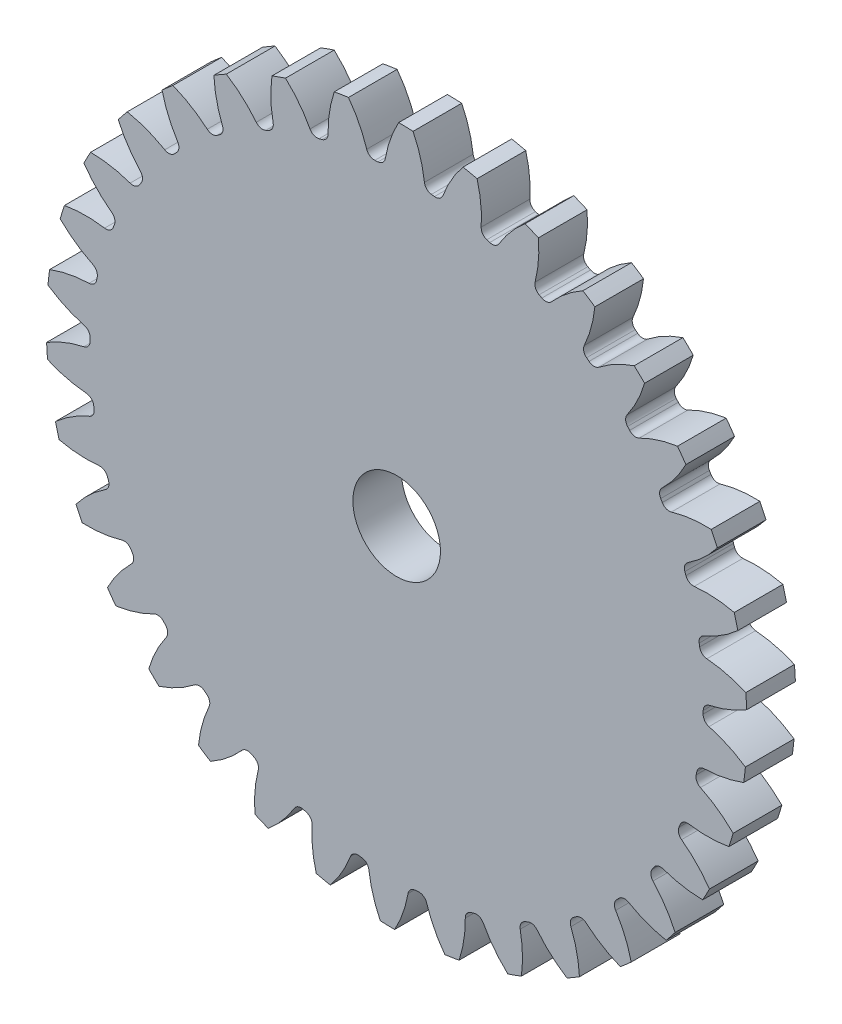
from build123d import *

# Parameters (mm, degrees)
SKETCH3_R         = 914.4
GEARBODY_DEPTH    = 127
TOOTHCUT_DEPTH    = 1300.378205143
CIRPATTERN1_COUNT = 34
BOREDIA_R         = 114.3
BORE_DEPTH        = 12700


with BuildPart() as part:
    # Sketch3 → gearBody (new body)
    with BuildSketch(Plane.XY):
        Circle(SKETCH3_R)
    extrude(amount=GEARBODY_DEPTH)

    # Sketch2 → toothCut (cut, through all)
    with BuildSketch(Plane.XY):
        with BuildLine():
            ThreePointArc((799.706651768, -25.085476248), (799.824250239, -21.004255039), (799.92102075, -16.922486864))
            ThreePointArc((799.92102075, -16.922486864), (804.640540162, -4.205641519), (816.225731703, 2.849523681))
            ThreePointArc((816.225731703, 2.849523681), (866.979387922, 18.393272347), (914.4, 42.243372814))
            ThreePointArc((914.4, 42.243372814), (915.059779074, -24.030465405), (910.922462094, -90.178326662))
            ThreePointArc((910.922462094, -90.178326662), (864.819007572, -63.87218245), (814.951135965, -45.686002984))
            ThreePointArc((814.951135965, -45.686002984), (803.75221, -38.032502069), (799.706651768, -25.085476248))
        make_face()
    toothcut = extrude(amount=TOOTHCUT_DEPTH, mode=Mode.SUBTRACT)

    # CirPattern1: toothCut ×34 about axis
    cirpattern1_axis = Axis((0, 0, 0), (0, 0, 1))
    for i in range(1, CIRPATTERN1_COUNT):
        add(toothcut.rotate(cirpattern1_axis, i * 360 / CIRPATTERN1_COUNT), mode=Mode.SUBTRACT)

    # boreDia → bore (cut, symmetric)
    with BuildSketch(Plane.XY):
        Circle(BOREDIA_R)
    extrude(amount=BORE_DEPTH, both=True, mode=Mode.SUBTRACT)


solid = part.part
